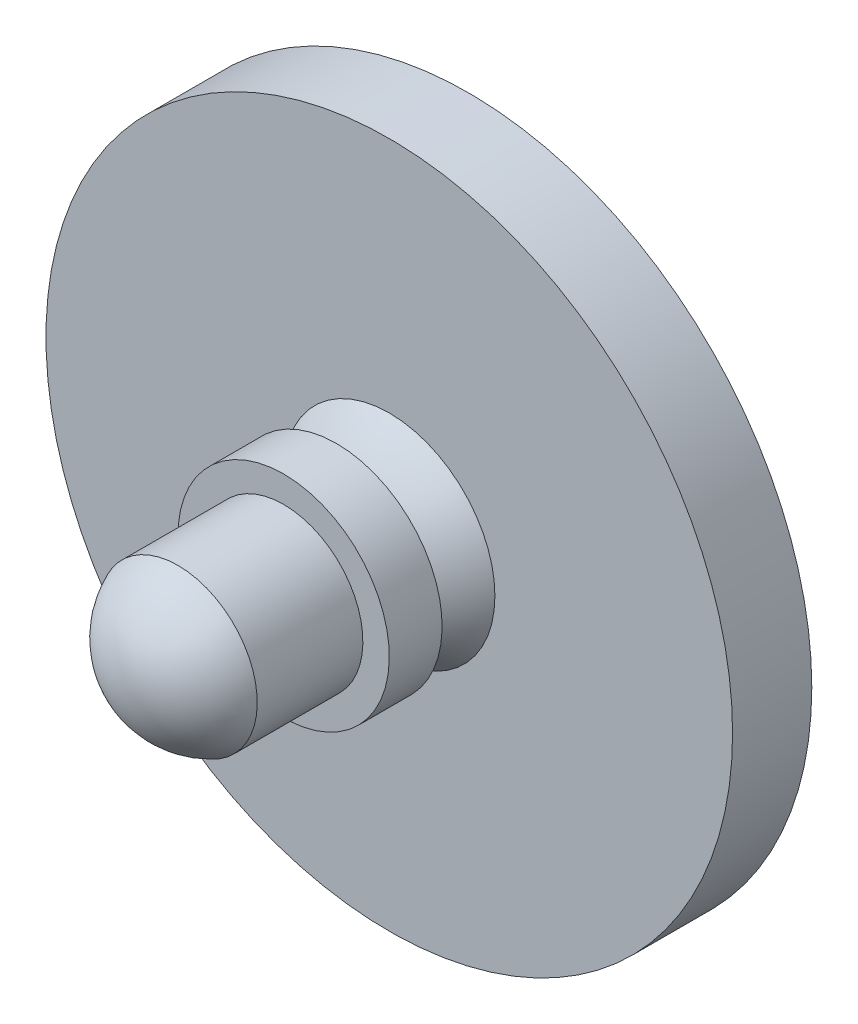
ISO-10303-21;
HEADER;
FILE_DESCRIPTION(('STEP AP214'),'2;1');
FILE_NAME('part.step','',(''),(''),'','','');
FILE_SCHEMA(('AUTOMOTIVE_DESIGN { 1 0 10303 214 1 1 1 1 }'));
ENDSEC;
DATA;
#1=APPLICATION_CONTEXT('core data for automotive mechanical design processes');
#2=APPLICATION_PROTOCOL_DEFINITION('international standard','automotive_design',2000,#1);
#3=PRODUCT_CONTEXT('',#1,'mechanical');
#4=PRODUCT('Part','Part','',(#3));
#5=PRODUCT_RELATED_PRODUCT_CATEGORY('part','',(#4));
#6=PRODUCT_DEFINITION_FORMATION('','',#4);
#7=PRODUCT_DEFINITION_CONTEXT('part definition',#1,'design');
#8=PRODUCT_DEFINITION('design','',#6,#7);
#9=PRODUCT_DEFINITION_SHAPE('','',#8);
#10=(LENGTH_UNIT() NAMED_UNIT(*) SI_UNIT(.MILLI.,.METRE.));
#11=(NAMED_UNIT(*) PLANE_ANGLE_UNIT() SI_UNIT($,.RADIAN.));
#12=(NAMED_UNIT(*) SI_UNIT($,.STERADIAN.) SOLID_ANGLE_UNIT());
#13=UNCERTAINTY_MEASURE_WITH_UNIT(LENGTH_MEASURE(1.E-05),#10,'distance_accuracy_value','');
#14=(GEOMETRIC_REPRESENTATION_CONTEXT(3) GLOBAL_UNCERTAINTY_ASSIGNED_CONTEXT((#13)) GLOBAL_UNIT_ASSIGNED_CONTEXT((#10,
#11,#12)) REPRESENTATION_CONTEXT('',''));
#15=CARTESIAN_POINT('',(0.,0.,0.));
#16=DIRECTION('',(0.,0.,1.));
#17=DIRECTION('',(1.,0.,0.));
#18=AXIS2_PLACEMENT_3D('',#15,#16,#17);
#19=CARTESIAN_POINT('',(0.,0.,4.875));
#20=DIRECTION('',(0.,0.,-1.));
#21=DIRECTION('',(0.,1.,0.));
#22=AXIS2_PLACEMENT_3D('',#19,#20,#21);
#23=SPHERICAL_SURFACE('',#22,1.625);
#24=CARTESIAN_POINT('',(0.,0.,5.5));
#25=DIRECTION('',(0.,0.,-1.));
#26=DIRECTION('',(0.,1.,0.));
#27=AXIS2_PLACEMENT_3D('',#24,#25,#26);
#28=CIRCLE('',#27,1.5);
#29=CARTESIAN_POINT('',(0.,1.5,5.5));
#30=VERTEX_POINT('',#29);
#31=EDGE_CURVE('E11',#30,#30,#28,.T.);
#32=ORIENTED_EDGE('',*,*,#31,.F.);
#33=EDGE_LOOP('',(#32));
#34=FACE_BOUND('',#33,.T.);
#35=ADVANCED_FACE('F39',(#34),#23,.T.);
#36=CARTESIAN_POINT('',(0.,0.,0.));
#37=DIRECTION('',(0.,0.,-1.));
#38=DIRECTION('',(0.,1.,0.));
#39=AXIS2_PLACEMENT_3D('',#36,#37,#38);
#40=CYLINDRICAL_SURFACE('',#39,1.5);
#41=ORIENTED_EDGE('',*,*,#31,.T.);
#42=EDGE_LOOP('',(#41));
#43=FACE_BOUND('',#42,.T.);
#44=CARTESIAN_POINT('',(0.,0.,3.5));
#45=DIRECTION('',(0.,0.,-1.));
#46=DIRECTION('',(0.,1.,0.));
#47=AXIS2_PLACEMENT_3D('',#44,#45,#46);
#48=CIRCLE('',#47,1.5);
#49=CARTESIAN_POINT('',(0.,1.5,3.5));
#50=VERTEX_POINT('',#49);
#51=EDGE_CURVE('E45',#50,#50,#48,.T.);
#52=ORIENTED_EDGE('',*,*,#51,.F.);
#53=EDGE_LOOP('',(#52));
#54=FACE_BOUND('',#53,.T.);
#55=ADVANCED_FACE('F71',(#43,#54),#40,.T.);
#56=CARTESIAN_POINT('',(0.,2.,3.5));
#57=DIRECTION('',(0.,0.,1.));
#58=DIRECTION('',(0.,-1.,0.));
#59=AXIS2_PLACEMENT_3D('',#56,#57,#58);
#60=PLANE('',#59);
#61=ORIENTED_EDGE('',*,*,#51,.T.);
#62=EDGE_LOOP('',(#61));
#63=FACE_BOUND('',#62,.T.);
#64=CARTESIAN_POINT('',(0.,0.,3.5));
#65=DIRECTION('',(0.,0.,-1.));
#66=DIRECTION('',(0.,1.,0.));
#67=AXIS2_PLACEMENT_3D('',#64,#65,#66);
#68=CIRCLE('',#67,2.);
#69=CARTESIAN_POINT('',(0.,2.,3.5));
#70=VERTEX_POINT('',#69);
#71=EDGE_CURVE('E49',#70,#70,#68,.T.);
#72=ORIENTED_EDGE('',*,*,#71,.F.);
#73=EDGE_LOOP('',(#72));
#74=FACE_BOUND('',#73,.T.);
#75=ADVANCED_FACE('F63',(#63,#74),#60,.T.);
#76=CARTESIAN_POINT('',(0.,0.,0.));
#77=DIRECTION('',(0.,0.,-1.));
#78=DIRECTION('',(0.,1.,0.));
#79=AXIS2_PLACEMENT_3D('',#76,#77,#78);
#80=CYLINDRICAL_SURFACE('',#79,2.);
#81=ORIENTED_EDGE('',*,*,#71,.T.);
#82=EDGE_LOOP('',(#81));
#83=FACE_BOUND('',#82,.T.);
#84=CARTESIAN_POINT('',(0.,0.,2.5));
#85=DIRECTION('',(0.,0.,-1.));
#86=DIRECTION('',(0.,1.,0.));
#87=AXIS2_PLACEMENT_3D('',#84,#85,#86);
#88=CIRCLE('',#87,2.);
#89=CARTESIAN_POINT('',(0.,2.,2.5));
#90=VERTEX_POINT('',#89);
#91=EDGE_CURVE('E53',#90,#90,#88,.T.);
#92=ORIENTED_EDGE('',*,*,#91,.F.);
#93=EDGE_LOOP('',(#92));
#94=FACE_BOUND('',#93,.T.);
#95=ADVANCED_FACE('F61',(#83,#94),#80,.T.);
#96=CARTESIAN_POINT('',(0.,0.,2.5));
#97=DIRECTION('',(0.,0.,-1.));
#98=DIRECTION('',(0.,1.,0.));
#99=AXIS2_PLACEMENT_3D('',#96,#97,#98);
#100=PLANE('',#99);
#101=ORIENTED_EDGE('',*,*,#91,.T.);
#102=EDGE_LOOP('',(#101));
#103=FACE_BOUND('',#102,.T.);
#104=ADVANCED_FACE('F59',(#103),#100,.T.);
#105=CLOSED_SHELL('',(#35,#55,#75,#95,#104));
#106=MANIFOLD_SOLID_BREP('B2',#105);
#107=CARTESIAN_POINT('',(0.,0.,1.5));
#108=DIRECTION('',(0.,0.,-1.));
#109=DIRECTION('',(-1.,0.,0.));
#110=AXIS2_PLACEMENT_3D('',#107,#108,#109);
#111=CYLINDRICAL_SURFACE('',#110,6.5);
#112=CARTESIAN_POINT('',(0.,0.,1.5));
#113=DIRECTION('',(0.,0.,1.));
#114=DIRECTION('',(1.,0.,0.));
#115=AXIS2_PLACEMENT_3D('',#112,#113,#114);
#116=CIRCLE('',#115,6.5);
#117=CARTESIAN_POINT('',(6.5,0.,1.5));
#118=VERTEX_POINT('',#117);
#119=EDGE_CURVE('E116',#118,#118,#116,.T.);
#120=ORIENTED_EDGE('',*,*,#119,.F.);
#121=EDGE_LOOP('',(#120));
#122=FACE_BOUND('',#121,.T.);
#123=CARTESIAN_POINT('',(0.,0.,0.));
#124=DIRECTION('',(0.,0.,1.));
#125=DIRECTION('',(1.,0.,0.));
#126=AXIS2_PLACEMENT_3D('',#123,#124,#125);
#127=CIRCLE('',#126,6.5);
#128=CARTESIAN_POINT('',(6.5,0.,0.));
#129=VERTEX_POINT('',#128);
#130=EDGE_CURVE('E120',#129,#129,#127,.T.);
#131=ORIENTED_EDGE('',*,*,#130,.T.);
#132=EDGE_LOOP('',(#131));
#133=FACE_BOUND('',#132,.T.);
#134=ADVANCED_FACE('F110',(#122,#133),#111,.T.);
#135=CARTESIAN_POINT('',(0.,0.,1.5));
#136=DIRECTION('',(0.,0.,1.));
#137=DIRECTION('',(1.,0.,0.));
#138=AXIS2_PLACEMENT_3D('',#135,#136,#137);
#139=PLANE('',#138);
#140=CARTESIAN_POINT('',(0.,0.,1.5));
#141=DIRECTION('',(0.,0.,1.));
#142=DIRECTION('',(1.,0.,0.));
#143=AXIS2_PLACEMENT_3D('',#140,#141,#142);
#144=CIRCLE('',#143,2.);
#145=CARTESIAN_POINT('',(2.,0.,1.5));
#146=VERTEX_POINT('',#145);
#147=EDGE_CURVE('E38',#146,#146,#144,.T.);
#148=ORIENTED_EDGE('',*,*,#147,.F.);
#149=EDGE_LOOP('',(#148));
#150=FACE_BOUND('',#149,.T.);
#151=ORIENTED_EDGE('',*,*,#119,.T.);
#152=EDGE_LOOP('',(#151));
#153=FACE_BOUND('',#152,.T.);
#154=ADVANCED_FACE('F142',(#150,#153),#139,.T.);
#155=CARTESIAN_POINT('',(0.,0.,0.));
#156=DIRECTION('',(0.,0.,1.));
#157=DIRECTION('',(1.,0.,0.));
#158=AXIS2_PLACEMENT_3D('',#155,#156,#157);
#159=PLANE('',#158);
#160=CARTESIAN_POINT('',(0.,0.,0.));
#161=DIRECTION('',(0.,0.,1.));
#162=DIRECTION('',(1.,0.,0.));
#163=AXIS2_PLACEMENT_3D('',#160,#161,#162);
#164=CIRCLE('',#163,2.5);
#165=CARTESIAN_POINT('',(2.5,0.,0.));
#166=VERTEX_POINT('',#165);
#167=EDGE_CURVE('E124',#166,#166,#164,.T.);
#168=ORIENTED_EDGE('',*,*,#167,.T.);
#169=EDGE_LOOP('',(#168));
#170=FACE_BOUND('',#169,.T.);
#171=ORIENTED_EDGE('',*,*,#130,.F.);
#172=EDGE_LOOP('',(#171));
#173=FACE_BOUND('',#172,.T.);
#174=ADVANCED_FACE('F130',(#170,#173),#159,.F.);
#175=CARTESIAN_POINT('',(0.,0.,0.5625));
#176=DIRECTION('',(0.,0.,1.));
#177=DIRECTION('',(1.,0.,0.));
#178=AXIS2_PLACEMENT_3D('',#175,#176,#177);
#179=SPHERICAL_SURFACE('',#178,2.5625);
#180=ORIENTED_EDGE('',*,*,#167,.F.);
#181=EDGE_LOOP('',(#180));
#182=FACE_BOUND('',#181,.T.);
#183=ADVANCED_FACE('F133',(#182),#179,.T.);
#184=CARTESIAN_POINT('',(0.,0.,0.));
#185=DIRECTION('',(0.,0.,-1.));
#186=DIRECTION('',(0.,1.,0.));
#187=AXIS2_PLACEMENT_3D('',#184,#185,#186);
#188=SPHERICAL_SURFACE('',#187,2.5);
#189=ORIENTED_EDGE('',*,*,#147,.T.);
#190=EDGE_LOOP('',(#189));
#191=FACE_BOUND('',#190,.T.);
#192=ADVANCED_FACE('F135',(#191),#188,.T.);
#193=CLOSED_SHELL('',(#134,#154,#174,#183,#192));
#194=MANIFOLD_SOLID_BREP('B6',#193);
#195=ADVANCED_BREP_SHAPE_REPRESENTATION('',(#18,#106,#194),#14);
#196=SHAPE_DEFINITION_REPRESENTATION(#9,#195);
ENDSEC;
END-ISO-10303-21;
